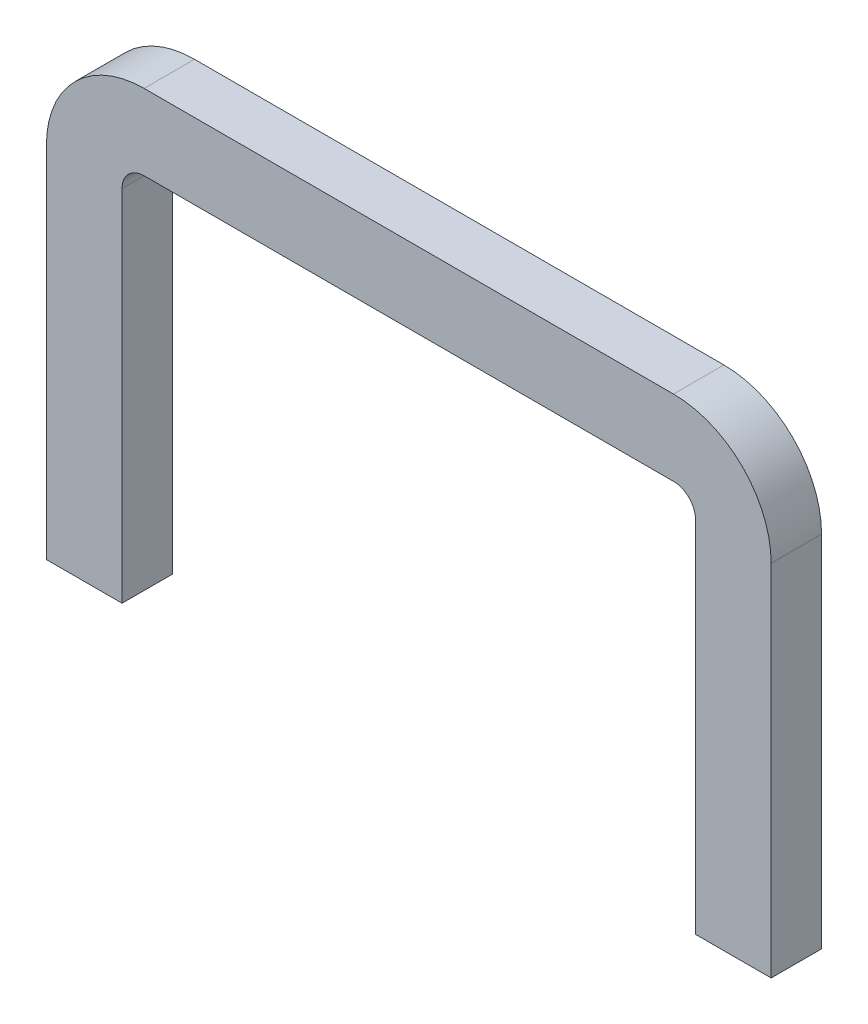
from build123d import *

# Parameters (mm, degrees)
EXTRUDE_1_DEPTH = 8


with BuildPart() as part:
    # Sketch 1 → Extrude 1 (new body)
    with BuildSketch(Plane.XY):
        with BuildLine():
            Line((57.5, 26.75), (57.5, -30.25))
            Line((57.5, -30.25), (45.5, -30.25))
            Line((45.5, -30.25), (45.5, 26.75))
            ThreePointArc((45.5, 26.75), (44.474873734, 29.224873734), (42, 30.25))
            Line((42, 30.25), (-42, 30.25))
            ThreePointArc((-42, 30.25), (-44.474873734, 29.224873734), (-45.5, 26.75))
            Line((-45.5, 26.75), (-45.5, -30.25))
            Line((-45.5, -30.25), (-57.5, -30.25))
            Line((-57.5, -30.25), (-57.5, 26.75))
            ThreePointArc((-57.5, 26.75), (-52.960155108, 37.710155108), (-42, 42.25))
            Line((-42, 42.25), (42, 42.25))
            ThreePointArc((42, 42.25), (52.960155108, 37.710155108), (57.5, 26.75))
        make_face()
    extrude(amount=EXTRUDE_1_DEPTH)


solid = part.part
